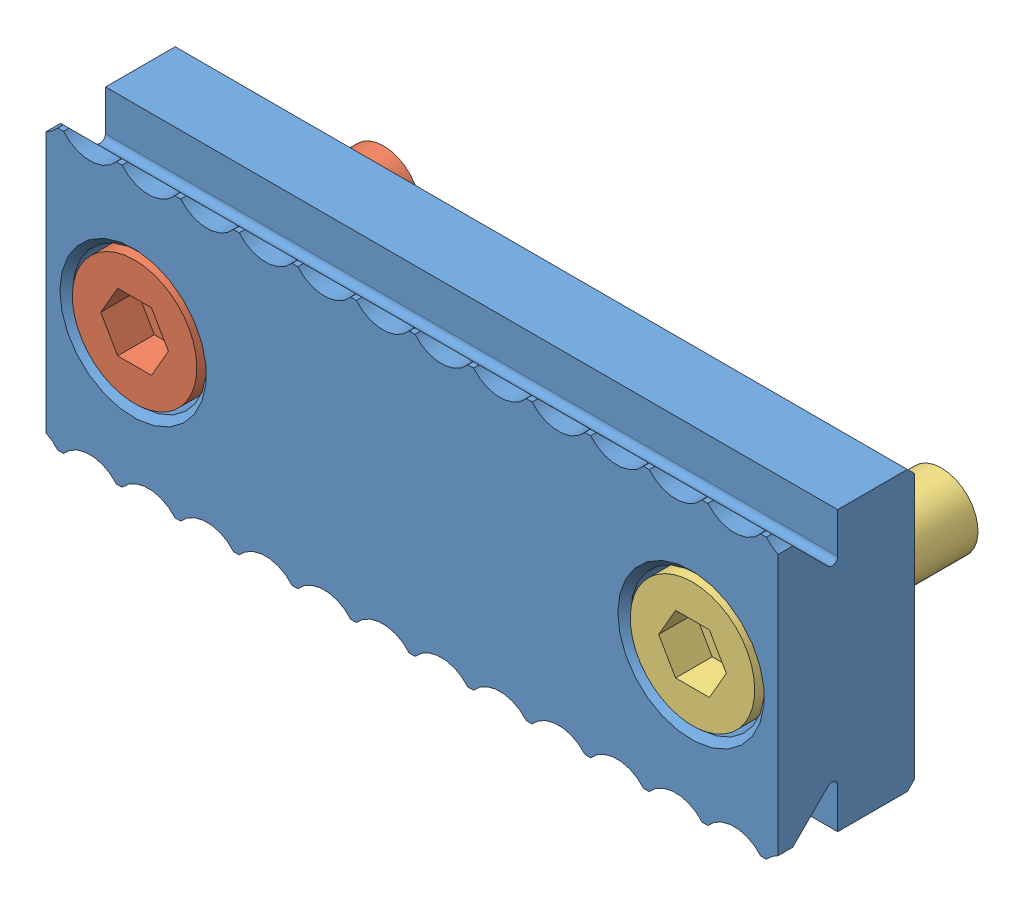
SolidWorks assembly TSG-50.SLDASM, configuration Default (file format 9000). Lengths in mm.
Overall size (50 19.05 17.1).
3 component instances, 3 part files, 0 mates.
Components (placement in the parent):
- TSG-50_01-1: TSG-50_01.sldprt [ﾃﾞﾌｫﾙﾄ] at (19.05 0 5.2578) x (-1 0 0) z (0 0 1) size (50 19.05 9.32)
- TSG-50_02-1: TSG-50_02.sldprt [ﾃﾞﾌｫﾙﾄ] at (0 0 4.2218) x (0 1 0) z (0 0 1) size (8.5 8.5 17)
- TSG-50_03-1: TSG-50_03.sldprt [ﾃﾞﾌｫﾙﾄ] at (38.1 0 4.2218) x (0 1 0) z (0 0 1) size (8.5 8.5 17)
